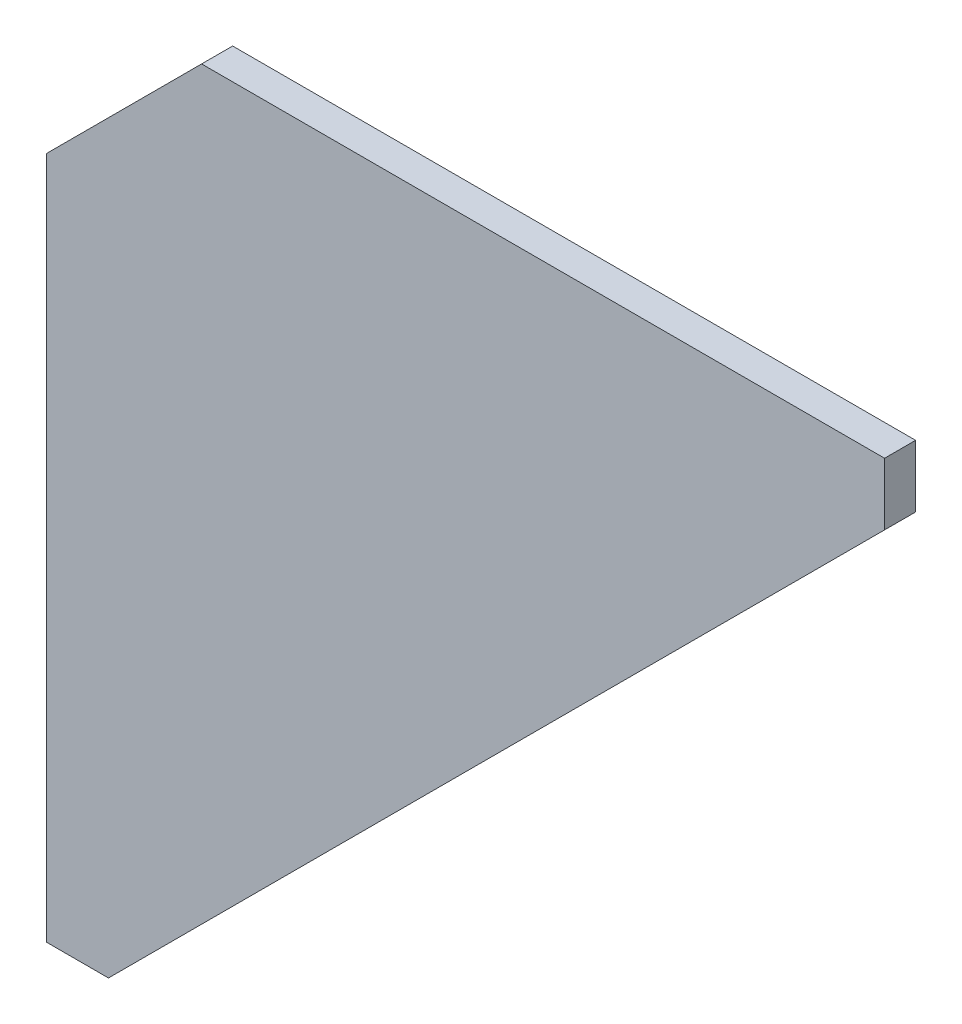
from build123d import *

# Parameters (mm, degrees)
LINEAR_AUSTRAGEN1_DEPTH = 10


with BuildPart() as part:
    # Skizze1 → Linear austragen1 (new body)
    with BuildSketch(Plane.XY):
        Polygon((0, 220), (50, 270), (270, 270), (270, 250), (20, 0), (0, 0), align=None)
    extrude(amount=LINEAR_AUSTRAGEN1_DEPTH)


solid = part.part
